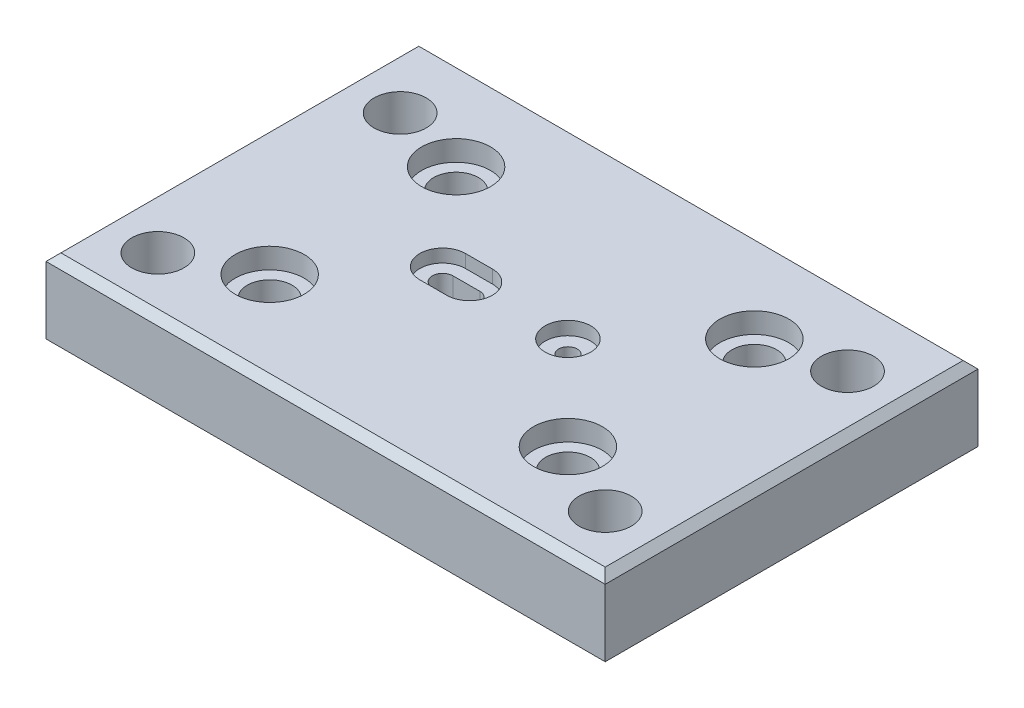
ISO-10303-21;
HEADER;
FILE_DESCRIPTION(('STEP AP214'),'2;1');
FILE_NAME('part.step','',(''),(''),'','','');
FILE_SCHEMA(('AUTOMOTIVE_DESIGN { 1 0 10303 214 1 1 1 1 }'));
ENDSEC;
DATA;
#1=APPLICATION_CONTEXT('core data for automotive mechanical design processes');
#2=APPLICATION_PROTOCOL_DEFINITION('international standard','automotive_design',2000,#1);
#3=PRODUCT_CONTEXT('',#1,'mechanical');
#4=PRODUCT('Part','Part','',(#3));
#5=PRODUCT_RELATED_PRODUCT_CATEGORY('part','',(#4));
#6=PRODUCT_DEFINITION_FORMATION('','',#4);
#7=PRODUCT_DEFINITION_CONTEXT('part definition',#1,'design');
#8=PRODUCT_DEFINITION('design','',#6,#7);
#9=PRODUCT_DEFINITION_SHAPE('','',#8);
#10=(LENGTH_UNIT() NAMED_UNIT(*) SI_UNIT(.MILLI.,.METRE.));
#11=(NAMED_UNIT(*) PLANE_ANGLE_UNIT() SI_UNIT($,.RADIAN.));
#12=(NAMED_UNIT(*) SI_UNIT($,.STERADIAN.) SOLID_ANGLE_UNIT());
#13=UNCERTAINTY_MEASURE_WITH_UNIT(LENGTH_MEASURE(1.E-05),#10,'distance_accuracy_value','');
#14=(GEOMETRIC_REPRESENTATION_CONTEXT(3) GLOBAL_UNCERTAINTY_ASSIGNED_CONTEXT((#13)) GLOBAL_UNIT_ASSIGNED_CONTEXT((#10,
#11,#12)) REPRESENTATION_CONTEXT('',''));
#15=CARTESIAN_POINT('',(0.,0.,0.));
#16=DIRECTION('',(0.,0.,1.));
#17=DIRECTION('',(1.,0.,0.));
#18=AXIS2_PLACEMENT_3D('',#15,#16,#17);
#19=CARTESIAN_POINT('',(-75.,20.,-50.));
#20=DIRECTION('',(1.,0.,0.));
#21=DIRECTION('',(0.,0.,-1.));
#22=AXIS2_PLACEMENT_3D('',#19,#20,#21);
#23=PLANE('',#22);
#24=DIRECTION('',(0.,-1.,0.));
#25=VECTOR('',#24,1.);
#26=CARTESIAN_POINT('',(-75.,20.,50.));
#27=LINE('',#26,#25);
#28=CARTESIAN_POINT('',(-75.,18.,50.));
#29=VERTEX_POINT('',#28);
#30=CARTESIAN_POINT('',(-75.,0.,50.));
#31=VERTEX_POINT('',#30);
#32=EDGE_CURVE('E322',#29,#31,#27,.T.);
#33=ORIENTED_EDGE('',*,*,#32,.F.);
#34=DIRECTION('',(0.,0.,-1.));
#35=VECTOR('',#34,1.);
#36=CARTESIAN_POINT('',(-75.,18.,-50.));
#37=LINE('',#36,#35);
#38=CARTESIAN_POINT('',(-75.,18.,-50.));
#39=VERTEX_POINT('',#38);
#40=EDGE_CURVE('E333',#29,#39,#37,.T.);
#41=ORIENTED_EDGE('',*,*,#40,.T.);
#42=DIRECTION('',(0.,-1.,0.));
#43=VECTOR('',#42,1.);
#44=CARTESIAN_POINT('',(-75.,20.,-50.));
#45=LINE('',#44,#43);
#46=CARTESIAN_POINT('',(-75.,0.,-50.));
#47=VERTEX_POINT('',#46);
#48=EDGE_CURVE('E316',#39,#47,#45,.T.);
#49=ORIENTED_EDGE('',*,*,#48,.T.);
#50=DIRECTION('',(0.,0.,1.));
#51=VECTOR('',#50,1.);
#52=CARTESIAN_POINT('',(-75.,0.,-50.));
#53=LINE('',#52,#51);
#54=EDGE_CURVE('E303',#47,#31,#53,.T.);
#55=ORIENTED_EDGE('',*,*,#54,.T.);
#56=EDGE_LOOP('',(#33,#41,#49,#55));
#57=FACE_BOUND('',#56,.T.);
#58=ADVANCED_FACE('F108',(#57),#23,.F.);
#59=CARTESIAN_POINT('',(-75.,20.,50.));
#60=DIRECTION('',(0.,0.,-1.));
#61=DIRECTION('',(-1.,0.,0.));
#62=AXIS2_PLACEMENT_3D('',#59,#60,#61);
#63=PLANE('',#62);
#64=DIRECTION('',(0.,-1.,0.));
#65=VECTOR('',#64,1.);
#66=CARTESIAN_POINT('',(75.,20.,50.));
#67=LINE('',#66,#65);
#68=CARTESIAN_POINT('',(75.,18.,50.));
#69=VERTEX_POINT('',#68);
#70=CARTESIAN_POINT('',(75.,0.,50.));
#71=VERTEX_POINT('',#70);
#72=EDGE_CURVE('E320',#69,#71,#67,.T.);
#73=ORIENTED_EDGE('',*,*,#72,.F.);
#74=DIRECTION('',(-1.,0.,0.));
#75=VECTOR('',#74,1.);
#76=CARTESIAN_POINT('',(-75.,18.,50.));
#77=LINE('',#76,#75);
#78=EDGE_CURVE('E340',#69,#29,#77,.T.);
#79=ORIENTED_EDGE('',*,*,#78,.T.);
#80=ORIENTED_EDGE('',*,*,#32,.T.);
#81=DIRECTION('',(1.,0.,0.));
#82=VECTOR('',#81,1.);
#83=CARTESIAN_POINT('',(-75.,0.,50.));
#84=LINE('',#83,#82);
#85=EDGE_CURVE('E306',#31,#71,#84,.T.);
#86=ORIENTED_EDGE('',*,*,#85,.T.);
#87=EDGE_LOOP('',(#73,#79,#80,#86));
#88=FACE_BOUND('',#87,.T.);
#89=ADVANCED_FACE('F516',(#88),#63,.F.);
#90=CARTESIAN_POINT('',(75.,20.,-50.));
#91=DIRECTION('',(-1.,0.,0.));
#92=DIRECTION('',(0.,0.,1.));
#93=AXIS2_PLACEMENT_3D('',#90,#91,#92);
#94=PLANE('',#93);
#95=DIRECTION('',(0.,-1.,0.));
#96=VECTOR('',#95,1.);
#97=CARTESIAN_POINT('',(75.,20.,-50.));
#98=LINE('',#97,#96);
#99=CARTESIAN_POINT('',(75.,18.,-50.));
#100=VERTEX_POINT('',#99);
#101=CARTESIAN_POINT('',(75.,0.,-50.));
#102=VERTEX_POINT('',#101);
#103=EDGE_CURVE('E318',#100,#102,#98,.T.);
#104=ORIENTED_EDGE('',*,*,#103,.F.);
#105=DIRECTION('',(0.,0.,1.));
#106=VECTOR('',#105,1.);
#107=CARTESIAN_POINT('',(75.,18.,50.));
#108=LINE('',#107,#106);
#109=EDGE_CURVE('E338',#100,#69,#108,.T.);
#110=ORIENTED_EDGE('',*,*,#109,.T.);
#111=ORIENTED_EDGE('',*,*,#72,.T.);
#112=DIRECTION('',(0.,0.,-1.));
#113=VECTOR('',#112,1.);
#114=CARTESIAN_POINT('',(75.,0.,-50.));
#115=LINE('',#114,#113);
#116=EDGE_CURVE('E310',#71,#102,#115,.T.);
#117=ORIENTED_EDGE('',*,*,#116,.T.);
#118=EDGE_LOOP('',(#104,#110,#111,#117));
#119=FACE_BOUND('',#118,.T.);
#120=ADVANCED_FACE('F511',(#119),#94,.F.);
#121=CARTESIAN_POINT('',(-75.,20.,-50.));
#122=DIRECTION('',(0.,0.,1.));
#123=DIRECTION('',(1.,0.,0.));
#124=AXIS2_PLACEMENT_3D('',#121,#122,#123);
#125=PLANE('',#124);
#126=ORIENTED_EDGE('',*,*,#48,.F.);
#127=DIRECTION('',(1.,0.,0.));
#128=VECTOR('',#127,1.);
#129=CARTESIAN_POINT('',(75.,18.,-50.));
#130=LINE('',#129,#128);
#131=EDGE_CURVE('E336',#39,#100,#130,.T.);
#132=ORIENTED_EDGE('',*,*,#131,.T.);
#133=ORIENTED_EDGE('',*,*,#103,.T.);
#134=DIRECTION('',(-1.,0.,0.));
#135=VECTOR('',#134,1.);
#136=CARTESIAN_POINT('',(-75.,0.,-50.));
#137=LINE('',#136,#135);
#138=EDGE_CURVE('E313',#102,#47,#137,.T.);
#139=ORIENTED_EDGE('',*,*,#138,.T.);
#140=EDGE_LOOP('',(#126,#132,#133,#139));
#141=FACE_BOUND('',#140,.T.);
#142=ADVANCED_FACE('F503',(#141),#125,.F.);
#143=CARTESIAN_POINT('',(-75.,20.,50.));
#144=DIRECTION('',(0.,1.,0.));
#145=DIRECTION('',(0.,0.,1.));
#146=AXIS2_PLACEMENT_3D('',#143,#144,#145);
#147=PLANE('',#146);
#148=CARTESIAN_POINT('',(15.,20.,0.));
#149=DIRECTION('',(0.,1.,0.));
#150=DIRECTION('',(0.,0.,1.));
#151=AXIS2_PLACEMENT_3D('',#148,#149,#150);
#152=CIRCLE('',#151,6.12);
#153=CARTESIAN_POINT('',(15.,20.,6.12));
#154=VERTEX_POINT('',#153);
#155=EDGE_CURVE('E414',#154,#154,#152,.T.);
#156=ORIENTED_EDGE('',*,*,#155,.F.);
#157=EDGE_LOOP('',(#156));
#158=FACE_BOUND('',#157,.T.);
#159=CARTESIAN_POINT('',(-11.4000163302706,20.,-0.0108433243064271));
#160=DIRECTION('',(0.,1.,0.));
#161=DIRECTION('',(0.,0.,1.));
#162=AXIS2_PLACEMENT_3D('',#159,#160,#161);
#163=CIRCLE('',#162,6.119);
#164=CARTESIAN_POINT('',(-11.3815856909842,20.,6.10812891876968));
#165=VERTEX_POINT('',#164);
#166=CARTESIAN_POINT('',(-11.418446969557,20.,-6.1298155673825));
#167=VERTEX_POINT('',#166);
#168=EDGE_CURVE('E242',#165,#167,#163,.T.);
#169=ORIENTED_EDGE('',*,*,#168,.F.);
#170=DIRECTION('',(0.999995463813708,0.,-0.0030120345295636));
#171=VECTOR('',#170,1.);
#172=CARTESIAN_POINT('',(-18.5815530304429,20.,6.12981556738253));
#173=LINE('',#172,#171);
#174=CARTESIAN_POINT('',(-18.581553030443,20.,6.12981556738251));
#175=VERTEX_POINT('',#174);
#176=EDGE_CURVE('E402',#175,#165,#173,.T.);
#177=ORIENTED_EDGE('',*,*,#176,.F.);
#178=CARTESIAN_POINT('',(-18.5999836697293,20.,0.0108433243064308));
#179=DIRECTION('',(0.,1.,0.));
#180=DIRECTION('',(0.,0.,1.));
#181=AXIS2_PLACEMENT_3D('',#178,#179,#180);
#182=CIRCLE('',#181,6.119);
#183=CARTESIAN_POINT('',(-18.6184143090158,20.,-6.10812891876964));
#184=VERTEX_POINT('',#183);
#185=EDGE_CURVE('E230',#184,#175,#182,.T.);
#186=ORIENTED_EDGE('',*,*,#185,.F.);
#187=DIRECTION('',(0.999995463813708,0.,-0.0030120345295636));
#188=VECTOR('',#187,1.);
#189=CARTESIAN_POINT('',(-18.6184143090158,20.,-6.10812891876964));
#190=LINE('',#189,#188);
#191=EDGE_CURVE('E218',#184,#167,#190,.T.);
#192=ORIENTED_EDGE('',*,*,#191,.T.);
#193=EDGE_LOOP('',(#169,#177,#186,#192));
#194=FACE_BOUND('',#193,.T.);
#195=CARTESIAN_POINT('',(60.,20.,-30.));
#196=DIRECTION('',(0.,1.,0.));
#197=DIRECTION('',(0.,0.,1.));
#198=AXIS2_PLACEMENT_3D('',#195,#196,#197);
#199=CIRCLE('',#198,6.99999999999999);
#200=CARTESIAN_POINT('',(60.,20.,-23.));
#201=VERTEX_POINT('',#200);
#202=EDGE_CURVE('E257',#201,#201,#199,.T.);
#203=ORIENTED_EDGE('',*,*,#202,.F.);
#204=EDGE_LOOP('',(#203));
#205=FACE_BOUND('',#204,.T.);
#206=CARTESIAN_POINT('',(-60.,20.,-30.));
#207=DIRECTION('',(0.,1.,0.));
#208=DIRECTION('',(0.,0.,1.));
#209=AXIS2_PLACEMENT_3D('',#206,#207,#208);
#210=CIRCLE('',#209,6.99999999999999);
#211=CARTESIAN_POINT('',(-60.,20.,-23.));
#212=VERTEX_POINT('',#211);
#213=EDGE_CURVE('E263',#212,#212,#210,.T.);
#214=ORIENTED_EDGE('',*,*,#213,.F.);
#215=EDGE_LOOP('',(#214));
#216=FACE_BOUND('',#215,.T.);
#217=CARTESIAN_POINT('',(60.,20.,35.));
#218=DIRECTION('',(0.,1.,0.));
#219=DIRECTION('',(0.,0.,1.));
#220=AXIS2_PLACEMENT_3D('',#217,#218,#219);
#221=CIRCLE('',#220,6.99999999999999);
#222=CARTESIAN_POINT('',(60.,20.,42.));
#223=VERTEX_POINT('',#222);
#224=EDGE_CURVE('E269',#223,#223,#221,.T.);
#225=ORIENTED_EDGE('',*,*,#224,.F.);
#226=EDGE_LOOP('',(#225));
#227=FACE_BOUND('',#226,.T.);
#228=CARTESIAN_POINT('',(-60.,20.,35.));
#229=DIRECTION('',(0.,1.,0.));
#230=DIRECTION('',(0.,0.,1.));
#231=AXIS2_PLACEMENT_3D('',#228,#229,#230);
#232=CIRCLE('',#231,6.99999999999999);
#233=CARTESIAN_POINT('',(-60.,20.,42.));
#234=VERTEX_POINT('',#233);
#235=EDGE_CURVE('E275',#234,#234,#232,.T.);
#236=ORIENTED_EDGE('',*,*,#235,.F.);
#237=EDGE_LOOP('',(#236));
#238=FACE_BOUND('',#237,.T.);
#239=CARTESIAN_POINT('',(40.,20.,25.));
#240=DIRECTION('',(0.,1.,0.));
#241=DIRECTION('',(0.,0.,1.));
#242=AXIS2_PLACEMENT_3D('',#239,#240,#241);
#243=CIRCLE('',#242,9.24999999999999);
#244=CARTESIAN_POINT('',(40.,20.,34.25));
#245=VERTEX_POINT('',#244);
#246=EDGE_CURVE('E281',#245,#245,#243,.T.);
#247=ORIENTED_EDGE('',*,*,#246,.F.);
#248=EDGE_LOOP('',(#247));
#249=FACE_BOUND('',#248,.T.);
#250=CARTESIAN_POINT('',(-40.,20.,25.));
#251=DIRECTION('',(0.,1.,0.));
#252=DIRECTION('',(0.,0.,1.));
#253=AXIS2_PLACEMENT_3D('',#250,#251,#252);
#254=CIRCLE('',#253,9.24999999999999);
#255=CARTESIAN_POINT('',(-40.,20.,34.25));
#256=VERTEX_POINT('',#255);
#257=EDGE_CURVE('E299',#256,#256,#254,.T.);
#258=ORIENTED_EDGE('',*,*,#257,.F.);
#259=EDGE_LOOP('',(#258));
#260=FACE_BOUND('',#259,.T.);
#261=DIRECTION('',(-1.,0.,0.));
#262=VECTOR('',#261,1.);
#263=CARTESIAN_POINT('',(-75.,20.,-48.));
#264=LINE('',#263,#262);
#265=CARTESIAN_POINT('',(73.,20.,-48.));
#266=VERTEX_POINT('',#265);
#267=CARTESIAN_POINT('',(-73.,20.,-48.));
#268=VERTEX_POINT('',#267);
#269=EDGE_CURVE('E328',#266,#268,#264,.T.);
#270=ORIENTED_EDGE('',*,*,#269,.T.);
#271=DIRECTION('',(0.,0.,1.));
#272=VECTOR('',#271,1.);
#273=CARTESIAN_POINT('',(-73.,20.,50.));
#274=LINE('',#273,#272);
#275=CARTESIAN_POINT('',(-73.,20.,48.));
#276=VERTEX_POINT('',#275);
#277=EDGE_CURVE('E330',#268,#276,#274,.T.);
#278=ORIENTED_EDGE('',*,*,#277,.T.);
#279=DIRECTION('',(1.,0.,0.));
#280=VECTOR('',#279,1.);
#281=CARTESIAN_POINT('',(75.,20.,48.));
#282=LINE('',#281,#280);
#283=CARTESIAN_POINT('',(73.,20.,48.));
#284=VERTEX_POINT('',#283);
#285=EDGE_CURVE('E324',#276,#284,#282,.T.);
#286=ORIENTED_EDGE('',*,*,#285,.T.);
#287=DIRECTION('',(0.,0.,-1.));
#288=VECTOR('',#287,1.);
#289=CARTESIAN_POINT('',(73.,20.,-50.));
#290=LINE('',#289,#288);
#291=EDGE_CURVE('E326',#284,#266,#290,.T.);
#292=ORIENTED_EDGE('',*,*,#291,.T.);
#293=EDGE_LOOP('',(#270,#278,#286,#292));
#294=FACE_BOUND('',#293,.T.);
#295=CARTESIAN_POINT('',(-40.,20.,-25.));
#296=DIRECTION('',(0.,1.,0.));
#297=DIRECTION('',(0.,0.,1.));
#298=AXIS2_PLACEMENT_3D('',#295,#296,#297);
#299=CIRCLE('',#298,9.24999999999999);
#300=CARTESIAN_POINT('',(-40.,20.,-15.75));
#301=VERTEX_POINT('',#300);
#302=EDGE_CURVE('E353',#301,#301,#299,.T.);
#303=ORIENTED_EDGE('',*,*,#302,.F.);
#304=EDGE_LOOP('',(#303));
#305=FACE_BOUND('',#304,.T.);
#306=CARTESIAN_POINT('',(40.,20.,-25.));
#307=DIRECTION('',(0.,1.,0.));
#308=DIRECTION('',(0.,0.,1.));
#309=AXIS2_PLACEMENT_3D('',#306,#307,#308);
#310=CIRCLE('',#309,9.24999999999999);
#311=CARTESIAN_POINT('',(40.,20.,-15.75));
#312=VERTEX_POINT('',#311);
#313=EDGE_CURVE('E365',#312,#312,#310,.T.);
#314=ORIENTED_EDGE('',*,*,#313,.F.);
#315=EDGE_LOOP('',(#314));
#316=FACE_BOUND('',#315,.T.);
#317=ADVANCED_FACE('F409',(#158,#194,#205,#216,#227,#238,#249,#260,#294,#305,#316),#147,.T.);
#318=CARTESIAN_POINT('',(-75.,0.,50.));
#319=DIRECTION('',(0.,1.,0.));
#320=DIRECTION('',(0.,0.,1.));
#321=AXIS2_PLACEMENT_3D('',#318,#319,#320);
#322=PLANE('',#321);
#323=CARTESIAN_POINT('',(15.,0.,0.));
#324=DIRECTION('',(0.,1.,0.));
#325=DIRECTION('',(0.,0.,1.));
#326=AXIS2_PLACEMENT_3D('',#323,#324,#325);
#327=CIRCLE('',#326,2.75);
#328=CARTESIAN_POINT('',(15.,0.,2.75));
#329=VERTEX_POINT('',#328);
#330=EDGE_CURVE('E442',#329,#329,#327,.T.);
#331=ORIENTED_EDGE('',*,*,#330,.T.);
#332=EDGE_LOOP('',(#331));
#333=FACE_BOUND('',#332,.T.);
#334=DIRECTION('',(0.999995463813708,0.,-0.0030120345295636));
#335=VECTOR('',#334,1.);
#336=CARTESIAN_POINT('',(-75.141773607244,0.,2.93116239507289));
#337=LINE('',#336,#335);
#338=CARTESIAN_POINT('',(-18.591700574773,0.,2.76083084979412));
#339=VERTEX_POINT('',#338);
#340=CARTESIAN_POINT('',(-11.3917332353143,0.,2.73914420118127));
#341=VERTEX_POINT('',#340);
#342=EDGE_CURVE('E377',#339,#341,#337,.T.);
#343=ORIENTED_EDGE('',*,*,#342,.T.);
#344=CARTESIAN_POINT('',(-11.4000163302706,0.,-0.0108433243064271));
#345=DIRECTION('',(0.,1.,0.));
#346=DIRECTION('',(0.,0.,1.));
#347=AXIS2_PLACEMENT_3D('',#344,#345,#346);
#348=CIRCLE('',#347,2.75);
#349=CARTESIAN_POINT('',(-11.4082994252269,0.,-2.76083084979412));
#350=VERTEX_POINT('',#349);
#351=EDGE_CURVE('E13',#341,#350,#348,.T.);
#352=ORIENTED_EDGE('',*,*,#351,.T.);
#353=DIRECTION('',(-0.999995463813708,0.,0.0030120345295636));
#354=VECTOR('',#353,1.);
#355=CARTESIAN_POINT('',(-75.1583397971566,0.,-2.5688126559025));
#356=LINE('',#355,#354);
#357=CARTESIAN_POINT('',(-18.6082667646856,0.,-2.73914420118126));
#358=VERTEX_POINT('',#357);
#359=EDGE_CURVE('E116',#350,#358,#356,.T.);
#360=ORIENTED_EDGE('',*,*,#359,.T.);
#361=CARTESIAN_POINT('',(-18.5999836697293,0.,0.0108433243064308));
#362=DIRECTION('',(0.,1.,0.));
#363=DIRECTION('',(0.,0.,1.));
#364=AXIS2_PLACEMENT_3D('',#361,#362,#363);
#365=CIRCLE('',#364,2.75);
#366=EDGE_CURVE('E374',#358,#339,#365,.T.);
#367=ORIENTED_EDGE('',*,*,#366,.T.);
#368=EDGE_LOOP('',(#343,#352,#360,#367));
#369=FACE_BOUND('',#368,.T.);
#370=CARTESIAN_POINT('',(60.,0.,-30.));
#371=DIRECTION('',(0.,1.,0.));
#372=DIRECTION('',(0.,0.,1.));
#373=AXIS2_PLACEMENT_3D('',#370,#371,#372);
#374=CIRCLE('',#373,6.99999999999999);
#375=CARTESIAN_POINT('',(60.,0.,-23.));
#376=VERTEX_POINT('',#375);
#377=EDGE_CURVE('E254',#376,#376,#374,.T.);
#378=ORIENTED_EDGE('',*,*,#377,.T.);
#379=EDGE_LOOP('',(#378));
#380=FACE_BOUND('',#379,.T.);
#381=CARTESIAN_POINT('',(-60.,0.,-30.));
#382=DIRECTION('',(0.,1.,0.));
#383=DIRECTION('',(0.,0.,1.));
#384=AXIS2_PLACEMENT_3D('',#381,#382,#383);
#385=CIRCLE('',#384,6.99999999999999);
#386=CARTESIAN_POINT('',(-60.,0.,-23.));
#387=VERTEX_POINT('',#386);
#388=EDGE_CURVE('E260',#387,#387,#385,.T.);
#389=ORIENTED_EDGE('',*,*,#388,.T.);
#390=EDGE_LOOP('',(#389));
#391=FACE_BOUND('',#390,.T.);
#392=CARTESIAN_POINT('',(60.,0.,35.));
#393=DIRECTION('',(0.,1.,0.));
#394=DIRECTION('',(0.,0.,1.));
#395=AXIS2_PLACEMENT_3D('',#392,#393,#394);
#396=CIRCLE('',#395,6.99999999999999);
#397=CARTESIAN_POINT('',(60.,0.,42.));
#398=VERTEX_POINT('',#397);
#399=EDGE_CURVE('E266',#398,#398,#396,.T.);
#400=ORIENTED_EDGE('',*,*,#399,.T.);
#401=EDGE_LOOP('',(#400));
#402=FACE_BOUND('',#401,.T.);
#403=CARTESIAN_POINT('',(-60.,0.,35.));
#404=DIRECTION('',(0.,1.,0.));
#405=DIRECTION('',(0.,0.,1.));
#406=AXIS2_PLACEMENT_3D('',#403,#404,#405);
#407=CIRCLE('',#406,6.99999999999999);
#408=CARTESIAN_POINT('',(-60.,0.,42.));
#409=VERTEX_POINT('',#408);
#410=EDGE_CURVE('E272',#409,#409,#407,.T.);
#411=ORIENTED_EDGE('',*,*,#410,.T.);
#412=EDGE_LOOP('',(#411));
#413=FACE_BOUND('',#412,.T.);
#414=CARTESIAN_POINT('',(40.,0.,25.));
#415=DIRECTION('',(0.,1.,0.));
#416=DIRECTION('',(0.,0.,1.));
#417=AXIS2_PLACEMENT_3D('',#414,#415,#416);
#418=CIRCLE('',#417,6.);
#419=CARTESIAN_POINT('',(40.,0.,31.));
#420=VERTEX_POINT('',#419);
#421=EDGE_CURVE('E278',#420,#420,#418,.T.);
#422=ORIENTED_EDGE('',*,*,#421,.T.);
#423=EDGE_LOOP('',(#422));
#424=FACE_BOUND('',#423,.T.);
#425=CARTESIAN_POINT('',(-40.,0.,25.));
#426=DIRECTION('',(0.,1.,0.));
#427=DIRECTION('',(0.,0.,1.));
#428=AXIS2_PLACEMENT_3D('',#425,#426,#427);
#429=CIRCLE('',#428,6.);
#430=CARTESIAN_POINT('',(-40.,0.,31.));
#431=VERTEX_POINT('',#430);
#432=EDGE_CURVE('E290',#431,#431,#429,.T.);
#433=ORIENTED_EDGE('',*,*,#432,.T.);
#434=EDGE_LOOP('',(#433));
#435=FACE_BOUND('',#434,.T.);
#436=ORIENTED_EDGE('',*,*,#54,.F.);
#437=ORIENTED_EDGE('',*,*,#138,.F.);
#438=ORIENTED_EDGE('',*,*,#116,.F.);
#439=ORIENTED_EDGE('',*,*,#85,.F.);
#440=EDGE_LOOP('',(#436,#437,#438,#439));
#441=FACE_BOUND('',#440,.T.);
#442=CARTESIAN_POINT('',(-40.,0.,-25.));
#443=DIRECTION('',(0.,1.,0.));
#444=DIRECTION('',(0.,0.,1.));
#445=AXIS2_PLACEMENT_3D('',#442,#443,#444);
#446=CIRCLE('',#445,6.);
#447=CARTESIAN_POINT('',(-40.,0.,-19.));
#448=VERTEX_POINT('',#447);
#449=EDGE_CURVE('E342',#448,#448,#446,.T.);
#450=ORIENTED_EDGE('',*,*,#449,.T.);
#451=EDGE_LOOP('',(#450));
#452=FACE_BOUND('',#451,.T.);
#453=CARTESIAN_POINT('',(40.,0.,-25.));
#454=DIRECTION('',(0.,1.,0.));
#455=DIRECTION('',(0.,0.,1.));
#456=AXIS2_PLACEMENT_3D('',#453,#454,#455);
#457=CIRCLE('',#456,6.);
#458=CARTESIAN_POINT('',(40.,0.,-19.));
#459=VERTEX_POINT('',#458);
#460=EDGE_CURVE('E362',#459,#459,#457,.T.);
#461=ORIENTED_EDGE('',*,*,#460,.T.);
#462=EDGE_LOOP('',(#461));
#463=FACE_BOUND('',#462,.T.);
#464=ADVANCED_FACE('F381',(#333,#369,#380,#391,#402,#413,#424,#435,#441,#452,#463),#322,.F.);
#465=CARTESIAN_POINT('',(73.,20.,50.));
#466=DIRECTION('',(0.707106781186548,0.707106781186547,0.));
#467=DIRECTION('',(-0.707106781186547,0.707106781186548,0.));
#468=AXIS2_PLACEMENT_3D('',#465,#466,#467);
#469=PLANE('',#468);
#470=DIRECTION('',(-0.577350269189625,0.577350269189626,-0.577350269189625));
#471=VECTOR('',#470,1.);
#472=CARTESIAN_POINT('',(23.6666666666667,69.3333333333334,-1.33333333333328));
#473=LINE('',#472,#471);
#474=EDGE_CURVE('E346',#69,#284,#473,.T.);
#475=ORIENTED_EDGE('',*,*,#474,.F.);
#476=ORIENTED_EDGE('',*,*,#109,.F.);
#477=DIRECTION('',(-0.577350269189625,0.577350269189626,0.577350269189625));
#478=VECTOR('',#477,1.);
#479=CARTESIAN_POINT('',(40.3333333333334,52.6666666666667,-15.3333333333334));
#480=LINE('',#479,#478);
#481=EDGE_CURVE('E307',#266,#100,#480,.F.);
#482=ORIENTED_EDGE('',*,*,#481,.F.);
#483=ORIENTED_EDGE('',*,*,#291,.F.);
#484=EDGE_LOOP('',(#475,#476,#482,#483));
#485=FACE_BOUND('',#484,.T.);
#486=ADVANCED_FACE('F509',(#485),#469,.T.);
#487=CARTESIAN_POINT('',(-75.,20.,-48.));
#488=DIRECTION('',(0.,0.707106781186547,-0.707106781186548));
#489=DIRECTION('',(0.,0.707106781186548,0.707106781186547));
#490=AXIS2_PLACEMENT_3D('',#487,#488,#489);
#491=PLANE('',#490);
#492=ORIENTED_EDGE('',*,*,#481,.T.);
#493=ORIENTED_EDGE('',*,*,#131,.F.);
#494=DIRECTION('',(0.577350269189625,0.577350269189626,0.577350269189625));
#495=VECTOR('',#494,1.);
#496=CARTESIAN_POINT('',(-73.6666666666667,19.3333333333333,-48.6666666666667));
#497=LINE('',#496,#495);
#498=EDGE_CURVE('E344',#268,#39,#497,.F.);
#499=ORIENTED_EDGE('',*,*,#498,.F.);
#500=ORIENTED_EDGE('',*,*,#269,.F.);
#501=EDGE_LOOP('',(#492,#493,#499,#500));
#502=FACE_BOUND('',#501,.T.);
#503=ADVANCED_FACE('F535',(#502),#491,.T.);
#504=CARTESIAN_POINT('',(-75.,20.,48.));
#505=DIRECTION('',(0.,0.707106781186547,0.707106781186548));
#506=DIRECTION('',(0.,-0.707106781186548,0.707106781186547));
#507=AXIS2_PLACEMENT_3D('',#504,#505,#506);
#508=PLANE('',#507);
#509=ORIENTED_EDGE('',*,*,#474,.T.);
#510=ORIENTED_EDGE('',*,*,#285,.F.);
#511=DIRECTION('',(-0.577350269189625,-0.577350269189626,0.577350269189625));
#512=VECTOR('',#511,1.);
#513=CARTESIAN_POINT('',(-73.6666666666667,19.3333333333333,48.6666666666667));
#514=LINE('',#513,#512);
#515=EDGE_CURVE('E302',#29,#276,#514,.F.);
#516=ORIENTED_EDGE('',*,*,#515,.F.);
#517=ORIENTED_EDGE('',*,*,#78,.F.);
#518=EDGE_LOOP('',(#509,#510,#516,#517));
#519=FACE_BOUND('',#518,.T.);
#520=ADVANCED_FACE('F531',(#519),#508,.T.);
#521=CARTESIAN_POINT('',(-73.,20.,50.));
#522=DIRECTION('',(-0.707106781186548,0.707106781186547,0.));
#523=DIRECTION('',(-0.707106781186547,-0.707106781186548,0.));
#524=AXIS2_PLACEMENT_3D('',#521,#522,#523);
#525=PLANE('',#524);
#526=ORIENTED_EDGE('',*,*,#498,.T.);
#527=ORIENTED_EDGE('',*,*,#40,.F.);
#528=ORIENTED_EDGE('',*,*,#515,.T.);
#529=ORIENTED_EDGE('',*,*,#277,.F.);
#530=EDGE_LOOP('',(#526,#527,#528,#529));
#531=FACE_BOUND('',#530,.T.);
#532=ADVANCED_FACE('F527',(#531),#525,.T.);
#533=CARTESIAN_POINT('',(-40.,20.,25.));
#534=DIRECTION('',(0.,1.,0.));
#535=DIRECTION('',(0.,0.,1.));
#536=AXIS2_PLACEMENT_3D('',#533,#534,#535);
#537=CYLINDRICAL_SURFACE('',#536,9.24999999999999);
#538=CARTESIAN_POINT('',(-40.,14.5,25.));
#539=DIRECTION('',(0.,1.,0.));
#540=DIRECTION('',(0.,0.,1.));
#541=AXIS2_PLACEMENT_3D('',#538,#539,#540);
#542=CIRCLE('',#541,9.24999999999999);
#543=CARTESIAN_POINT('',(-40.,14.5,34.25));
#544=VERTEX_POINT('',#543);
#545=EDGE_CURVE('E296',#544,#544,#542,.T.);
#546=ORIENTED_EDGE('',*,*,#545,.F.);
#547=EDGE_LOOP('',(#546));
#548=FACE_BOUND('',#547,.T.);
#549=ORIENTED_EDGE('',*,*,#257,.T.);
#550=EDGE_LOOP('',(#549));
#551=FACE_BOUND('',#550,.T.);
#552=ADVANCED_FACE('F530',(#548,#551),#537,.F.);
#553=CARTESIAN_POINT('',(-34.,14.5,25.));
#554=DIRECTION('',(0.,-1.,0.));
#555=DIRECTION('',(0.,0.,-1.));
#556=AXIS2_PLACEMENT_3D('',#553,#554,#555);
#557=PLANE('',#556);
#558=CARTESIAN_POINT('',(-40.,14.5,25.));
#559=DIRECTION('',(0.,1.,0.));
#560=DIRECTION('',(0.,0.,1.));
#561=AXIS2_PLACEMENT_3D('',#558,#559,#560);
#562=CIRCLE('',#561,6.);
#563=CARTESIAN_POINT('',(-40.,14.5,31.));
#564=VERTEX_POINT('',#563);
#565=EDGE_CURVE('E293',#564,#564,#562,.T.);
#566=ORIENTED_EDGE('',*,*,#565,.F.);
#567=EDGE_LOOP('',(#566));
#568=FACE_BOUND('',#567,.T.);
#569=ORIENTED_EDGE('',*,*,#545,.T.);
#570=EDGE_LOOP('',(#569));
#571=FACE_BOUND('',#570,.T.);
#572=ADVANCED_FACE('F620',(#568,#571),#557,.F.);
#573=CARTESIAN_POINT('',(-40.,20.,25.));
#574=DIRECTION('',(0.,1.,0.));
#575=DIRECTION('',(0.,0.,1.));
#576=AXIS2_PLACEMENT_3D('',#573,#574,#575);
#577=CYLINDRICAL_SURFACE('',#576,6.);
#578=ORIENTED_EDGE('',*,*,#432,.F.);
#579=EDGE_LOOP('',(#578));
#580=FACE_BOUND('',#579,.T.);
#581=ORIENTED_EDGE('',*,*,#565,.T.);
#582=EDGE_LOOP('',(#581));
#583=FACE_BOUND('',#582,.T.);
#584=ADVANCED_FACE('F612',(#580,#583),#577,.F.);
#585=CARTESIAN_POINT('',(40.,20.,25.));
#586=DIRECTION('',(0.,1.,0.));
#587=DIRECTION('',(0.,0.,1.));
#588=AXIS2_PLACEMENT_3D('',#585,#586,#587);
#589=CYLINDRICAL_SURFACE('',#588,9.24999999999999);
#590=CARTESIAN_POINT('',(40.,14.5,25.));
#591=DIRECTION('',(0.,1.,0.));
#592=DIRECTION('',(0.,0.,1.));
#593=AXIS2_PLACEMENT_3D('',#590,#591,#592);
#594=CIRCLE('',#593,9.24999999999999);
#595=CARTESIAN_POINT('',(40.,14.5,34.25));
#596=VERTEX_POINT('',#595);
#597=EDGE_CURVE('E287',#596,#596,#594,.T.);
#598=ORIENTED_EDGE('',*,*,#597,.F.);
#599=EDGE_LOOP('',(#598));
#600=FACE_BOUND('',#599,.T.);
#601=ORIENTED_EDGE('',*,*,#246,.T.);
#602=EDGE_LOOP('',(#601));
#603=FACE_BOUND('',#602,.T.);
#604=ADVANCED_FACE('F604',(#600,#603),#589,.F.);
#605=CARTESIAN_POINT('',(46.,14.5,25.));
#606=DIRECTION('',(0.,-1.,0.));
#607=DIRECTION('',(0.,0.,-1.));
#608=AXIS2_PLACEMENT_3D('',#605,#606,#607);
#609=PLANE('',#608);
#610=CARTESIAN_POINT('',(40.,14.5,25.));
#611=DIRECTION('',(0.,1.,0.));
#612=DIRECTION('',(0.,0.,1.));
#613=AXIS2_PLACEMENT_3D('',#610,#611,#612);
#614=CIRCLE('',#613,6.);
#615=CARTESIAN_POINT('',(40.,14.5,31.));
#616=VERTEX_POINT('',#615);
#617=EDGE_CURVE('E284',#616,#616,#614,.T.);
#618=ORIENTED_EDGE('',*,*,#617,.F.);
#619=EDGE_LOOP('',(#618));
#620=FACE_BOUND('',#619,.T.);
#621=ORIENTED_EDGE('',*,*,#597,.T.);
#622=EDGE_LOOP('',(#621));
#623=FACE_BOUND('',#622,.T.);
#624=ADVANCED_FACE('F596',(#620,#623),#609,.F.);
#625=CARTESIAN_POINT('',(40.,20.,25.));
#626=DIRECTION('',(0.,1.,0.));
#627=DIRECTION('',(0.,0.,1.));
#628=AXIS2_PLACEMENT_3D('',#625,#626,#627);
#629=CYLINDRICAL_SURFACE('',#628,6.);
#630=ORIENTED_EDGE('',*,*,#421,.F.);
#631=EDGE_LOOP('',(#630));
#632=FACE_BOUND('',#631,.T.);
#633=ORIENTED_EDGE('',*,*,#617,.T.);
#634=EDGE_LOOP('',(#633));
#635=FACE_BOUND('',#634,.T.);
#636=ADVANCED_FACE('F554',(#632,#635),#629,.F.);
#637=CARTESIAN_POINT('',(-40.,20.,-25.));
#638=DIRECTION('',(0.,1.,0.));
#639=DIRECTION('',(0.,0.,1.));
#640=AXIS2_PLACEMENT_3D('',#637,#638,#639);
#641=CYLINDRICAL_SURFACE('',#640,6.);
#642=ORIENTED_EDGE('',*,*,#449,.F.);
#643=EDGE_LOOP('',(#642));
#644=FACE_BOUND('',#643,.T.);
#645=CARTESIAN_POINT('',(-40.,14.5,-25.));
#646=DIRECTION('',(0.,1.,0.));
#647=DIRECTION('',(0.,0.,1.));
#648=AXIS2_PLACEMENT_3D('',#645,#646,#647);
#649=CIRCLE('',#648,6.);
#650=CARTESIAN_POINT('',(-40.,14.5,-19.));
#651=VERTEX_POINT('',#650);
#652=EDGE_CURVE('E359',#651,#651,#649,.T.);
#653=ORIENTED_EDGE('',*,*,#652,.T.);
#654=EDGE_LOOP('',(#653));
#655=FACE_BOUND('',#654,.T.);
#656=ADVANCED_FACE('F550',(#644,#655),#641,.F.);
#657=CARTESIAN_POINT('',(-34.,14.5,-25.));
#658=DIRECTION('',(0.,-1.,0.));
#659=DIRECTION('',(0.,0.,-1.));
#660=AXIS2_PLACEMENT_3D('',#657,#658,#659);
#661=PLANE('',#660);
#662=ORIENTED_EDGE('',*,*,#652,.F.);
#663=EDGE_LOOP('',(#662));
#664=FACE_BOUND('',#663,.T.);
#665=CARTESIAN_POINT('',(-40.,14.5,-25.));
#666=DIRECTION('',(0.,1.,0.));
#667=DIRECTION('',(0.,0.,1.));
#668=AXIS2_PLACEMENT_3D('',#665,#666,#667);
#669=CIRCLE('',#668,9.24999999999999);
#670=CARTESIAN_POINT('',(-40.,14.5,-15.75));
#671=VERTEX_POINT('',#670);
#672=EDGE_CURVE('E356',#671,#671,#669,.T.);
#673=ORIENTED_EDGE('',*,*,#672,.T.);
#674=EDGE_LOOP('',(#673));
#675=FACE_BOUND('',#674,.T.);
#676=ADVANCED_FACE('F546',(#664,#675),#661,.F.);
#677=CARTESIAN_POINT('',(-40.,20.,-25.));
#678=DIRECTION('',(0.,1.,0.));
#679=DIRECTION('',(0.,0.,1.));
#680=AXIS2_PLACEMENT_3D('',#677,#678,#679);
#681=CYLINDRICAL_SURFACE('',#680,9.24999999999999);
#682=ORIENTED_EDGE('',*,*,#672,.F.);
#683=EDGE_LOOP('',(#682));
#684=FACE_BOUND('',#683,.T.);
#685=ORIENTED_EDGE('',*,*,#302,.T.);
#686=EDGE_LOOP('',(#685));
#687=FACE_BOUND('',#686,.T.);
#688=ADVANCED_FACE('F543',(#684,#687),#681,.F.);
#689=CARTESIAN_POINT('',(40.,20.,-25.));
#690=DIRECTION('',(0.,1.,0.));
#691=DIRECTION('',(0.,0.,1.));
#692=AXIS2_PLACEMENT_3D('',#689,#690,#691);
#693=CYLINDRICAL_SURFACE('',#692,6.);
#694=ORIENTED_EDGE('',*,*,#460,.F.);
#695=EDGE_LOOP('',(#694));
#696=FACE_BOUND('',#695,.T.);
#697=CARTESIAN_POINT('',(40.,14.5,-25.));
#698=DIRECTION('',(0.,1.,0.));
#699=DIRECTION('',(0.,0.,1.));
#700=AXIS2_PLACEMENT_3D('',#697,#698,#699);
#701=CIRCLE('',#700,6.);
#702=CARTESIAN_POINT('',(40.,14.5,-19.));
#703=VERTEX_POINT('',#702);
#704=EDGE_CURVE('E371',#703,#703,#701,.T.);
#705=ORIENTED_EDGE('',*,*,#704,.T.);
#706=EDGE_LOOP('',(#705));
#707=FACE_BOUND('',#706,.T.);
#708=ADVANCED_FACE('F110',(#696,#707),#693,.F.);
#709=CARTESIAN_POINT('',(46.,14.5,-25.));
#710=DIRECTION('',(0.,-1.,0.));
#711=DIRECTION('',(0.,0.,-1.));
#712=AXIS2_PLACEMENT_3D('',#709,#710,#711);
#713=PLANE('',#712);
#714=ORIENTED_EDGE('',*,*,#704,.F.);
#715=EDGE_LOOP('',(#714));
#716=FACE_BOUND('',#715,.T.);
#717=CARTESIAN_POINT('',(40.,14.5,-25.));
#718=DIRECTION('',(0.,1.,0.));
#719=DIRECTION('',(0.,0.,1.));
#720=AXIS2_PLACEMENT_3D('',#717,#718,#719);
#721=CIRCLE('',#720,9.24999999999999);
#722=CARTESIAN_POINT('',(40.,14.5,-15.75));
#723=VERTEX_POINT('',#722);
#724=EDGE_CURVE('E368',#723,#723,#721,.T.);
#725=ORIENTED_EDGE('',*,*,#724,.T.);
#726=EDGE_LOOP('',(#725));
#727=FACE_BOUND('',#726,.T.);
#728=ADVANCED_FACE('F559',(#716,#727),#713,.F.);
#729=CARTESIAN_POINT('',(40.,20.,-25.));
#730=DIRECTION('',(0.,1.,0.));
#731=DIRECTION('',(0.,0.,1.));
#732=AXIS2_PLACEMENT_3D('',#729,#730,#731);
#733=CYLINDRICAL_SURFACE('',#732,9.24999999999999);
#734=ORIENTED_EDGE('',*,*,#724,.F.);
#735=EDGE_LOOP('',(#734));
#736=FACE_BOUND('',#735,.T.);
#737=ORIENTED_EDGE('',*,*,#313,.T.);
#738=EDGE_LOOP('',(#737));
#739=FACE_BOUND('',#738,.T.);
#740=ADVANCED_FACE('F556',(#736,#739),#733,.F.);
#741=CARTESIAN_POINT('',(-60.,20.,35.));
#742=DIRECTION('',(0.,1.,0.));
#743=DIRECTION('',(0.,0.,1.));
#744=AXIS2_PLACEMENT_3D('',#741,#742,#743);
#745=CYLINDRICAL_SURFACE('',#744,6.99999999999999);
#746=ORIENTED_EDGE('',*,*,#410,.F.);
#747=EDGE_LOOP('',(#746));
#748=FACE_BOUND('',#747,.T.);
#749=ORIENTED_EDGE('',*,*,#235,.T.);
#750=EDGE_LOOP('',(#749));
#751=FACE_BOUND('',#750,.T.);
#752=ADVANCED_FACE('F558',(#748,#751),#745,.F.);
#753=CARTESIAN_POINT('',(60.,20.,35.));
#754=DIRECTION('',(0.,1.,0.));
#755=DIRECTION('',(0.,0.,1.));
#756=AXIS2_PLACEMENT_3D('',#753,#754,#755);
#757=CYLINDRICAL_SURFACE('',#756,6.99999999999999);
#758=ORIENTED_EDGE('',*,*,#399,.F.);
#759=EDGE_LOOP('',(#758));
#760=FACE_BOUND('',#759,.T.);
#761=ORIENTED_EDGE('',*,*,#224,.T.);
#762=EDGE_LOOP('',(#761));
#763=FACE_BOUND('',#762,.T.);
#764=ADVANCED_FACE('F786',(#760,#763),#757,.F.);
#765=CARTESIAN_POINT('',(-60.,20.,-30.));
#766=DIRECTION('',(0.,1.,0.));
#767=DIRECTION('',(0.,0.,1.));
#768=AXIS2_PLACEMENT_3D('',#765,#766,#767);
#769=CYLINDRICAL_SURFACE('',#768,6.99999999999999);
#770=ORIENTED_EDGE('',*,*,#388,.F.);
#771=EDGE_LOOP('',(#770));
#772=FACE_BOUND('',#771,.T.);
#773=ORIENTED_EDGE('',*,*,#213,.T.);
#774=EDGE_LOOP('',(#773));
#775=FACE_BOUND('',#774,.T.);
#776=ADVANCED_FACE('F778',(#772,#775),#769,.F.);
#777=CARTESIAN_POINT('',(60.,20.,-30.));
#778=DIRECTION('',(0.,1.,0.));
#779=DIRECTION('',(0.,0.,1.));
#780=AXIS2_PLACEMENT_3D('',#777,#778,#779);
#781=CYLINDRICAL_SURFACE('',#780,6.99999999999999);
#782=ORIENTED_EDGE('',*,*,#377,.F.);
#783=EDGE_LOOP('',(#782));
#784=FACE_BOUND('',#783,.T.);
#785=ORIENTED_EDGE('',*,*,#202,.T.);
#786=EDGE_LOOP('',(#785));
#787=FACE_BOUND('',#786,.T.);
#788=ADVANCED_FACE('F771',(#784,#787),#781,.F.);
#789=CARTESIAN_POINT('',(-11.4000163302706,20.,-0.0108433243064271));
#790=DIRECTION('',(0.,1.,0.));
#791=DIRECTION('',(0.,0.,1.));
#792=AXIS2_PLACEMENT_3D('',#789,#790,#791);
#793=CYLINDRICAL_SURFACE('',#792,2.75);
#794=DIRECTION('',(0.,1.,0.));
#795=VECTOR('',#794,1.);
#796=CARTESIAN_POINT('',(-11.3917332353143,20.,2.73914420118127));
#797=LINE('',#796,#795);
#798=CARTESIAN_POINT('',(-11.3917332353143,16.5,2.73914420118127));
#799=VERTEX_POINT('',#798);
#800=EDGE_CURVE('E239',#799,#341,#797,.F.);
#801=ORIENTED_EDGE('',*,*,#800,.F.);
#802=CARTESIAN_POINT('',(-11.4000163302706,16.5,-0.0108433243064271));
#803=DIRECTION('',(0.,1.,0.));
#804=DIRECTION('',(0.,0.,1.));
#805=AXIS2_PLACEMENT_3D('',#802,#803,#804);
#806=CIRCLE('',#805,2.75);
#807=CARTESIAN_POINT('',(-11.4082994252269,16.5,-2.76083084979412));
#808=VERTEX_POINT('',#807);
#809=EDGE_CURVE('E246',#799,#808,#806,.T.);
#810=ORIENTED_EDGE('',*,*,#809,.T.);
#811=DIRECTION('',(0.,1.,0.));
#812=VECTOR('',#811,1.);
#813=CARTESIAN_POINT('',(-11.4082994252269,20.,-2.76083084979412));
#814=LINE('',#813,#812);
#815=EDGE_CURVE('E224',#350,#808,#814,.T.);
#816=ORIENTED_EDGE('',*,*,#815,.F.);
#817=ORIENTED_EDGE('',*,*,#351,.F.);
#818=EDGE_LOOP('',(#801,#810,#816,#817));
#819=FACE_BOUND('',#818,.T.);
#820=ADVANCED_FACE('F391',(#819),#793,.F.);
#821=CARTESIAN_POINT('',(-18.6082667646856,20.,-2.73914420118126));
#822=DIRECTION('',(-0.0030120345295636,0.,-0.999995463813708));
#823=DIRECTION('',(-0.999995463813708,0.,0.0030120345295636));
#824=AXIS2_PLACEMENT_3D('',#821,#822,#823);
#825=PLANE('',#824);
#826=ORIENTED_EDGE('',*,*,#815,.T.);
#827=DIRECTION('',(0.999995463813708,0.,-0.0030120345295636));
#828=VECTOR('',#827,1.);
#829=CARTESIAN_POINT('',(-18.6082667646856,16.5,-2.73914420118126));
#830=LINE('',#829,#828);
#831=CARTESIAN_POINT('',(-18.6082667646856,16.5,-2.73914420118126));
#832=VERTEX_POINT('',#831);
#833=EDGE_CURVE('E219',#832,#808,#830,.T.);
#834=ORIENTED_EDGE('',*,*,#833,.F.);
#835=DIRECTION('',(0.,1.,0.));
#836=VECTOR('',#835,1.);
#837=CARTESIAN_POINT('',(-18.6082667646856,20.,-2.73914420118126));
#838=LINE('',#837,#836);
#839=EDGE_CURVE('E233',#832,#358,#838,.F.);
#840=ORIENTED_EDGE('',*,*,#839,.T.);
#841=ORIENTED_EDGE('',*,*,#359,.F.);
#842=EDGE_LOOP('',(#826,#834,#840,#841));
#843=FACE_BOUND('',#842,.T.);
#844=ADVANCED_FACE('F386',(#843),#825,.F.);
#845=CARTESIAN_POINT('',(-18.591700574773,20.,2.76083084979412));
#846=DIRECTION('',(0.0030120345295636,0.,0.999995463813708));
#847=DIRECTION('',(0.999995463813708,0.,-0.0030120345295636));
#848=AXIS2_PLACEMENT_3D('',#845,#846,#847);
#849=PLANE('',#848);
#850=DIRECTION('',(0.,1.,0.));
#851=VECTOR('',#850,1.);
#852=CARTESIAN_POINT('',(-18.591700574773,20.,2.76083084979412));
#853=LINE('',#852,#851);
#854=CARTESIAN_POINT('',(-18.591700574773,16.5,2.76083084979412));
#855=VERTEX_POINT('',#854);
#856=EDGE_CURVE('E123',#339,#855,#853,.T.);
#857=ORIENTED_EDGE('',*,*,#856,.T.);
#858=DIRECTION('',(0.999995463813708,0.,-0.0030120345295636));
#859=VECTOR('',#858,1.);
#860=CARTESIAN_POINT('',(-18.591700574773,16.5,2.76083084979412));
#861=LINE('',#860,#859);
#862=EDGE_CURVE('E396',#855,#799,#861,.T.);
#863=ORIENTED_EDGE('',*,*,#862,.T.);
#864=ORIENTED_EDGE('',*,*,#800,.T.);
#865=ORIENTED_EDGE('',*,*,#342,.F.);
#866=EDGE_LOOP('',(#857,#863,#864,#865));
#867=FACE_BOUND('',#866,.T.);
#868=ADVANCED_FACE('F398',(#867),#849,.F.);
#869=CARTESIAN_POINT('',(-18.5999836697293,20.,0.0108433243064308));
#870=DIRECTION('',(0.,1.,0.));
#871=DIRECTION('',(0.,0.,1.));
#872=AXIS2_PLACEMENT_3D('',#869,#870,#871);
#873=CYLINDRICAL_SURFACE('',#872,2.75);
#874=ORIENTED_EDGE('',*,*,#839,.F.);
#875=CARTESIAN_POINT('',(-18.5999836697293,16.5,0.0108433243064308));
#876=DIRECTION('',(0.,1.,0.));
#877=DIRECTION('',(0.,0.,1.));
#878=AXIS2_PLACEMENT_3D('',#875,#876,#877);
#879=CIRCLE('',#878,2.75);
#880=EDGE_CURVE('E229',#832,#855,#879,.T.);
#881=ORIENTED_EDGE('',*,*,#880,.T.);
#882=ORIENTED_EDGE('',*,*,#856,.F.);
#883=ORIENTED_EDGE('',*,*,#366,.F.);
#884=EDGE_LOOP('',(#874,#881,#882,#883));
#885=FACE_BOUND('',#884,.T.);
#886=ADVANCED_FACE('F746',(#885),#873,.F.);
#887=CARTESIAN_POINT('',(-8.65001633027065,16.5,-0.0108433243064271));
#888=DIRECTION('',(0.,-1.,0.));
#889=DIRECTION('',(0.,0.,-1.));
#890=AXIS2_PLACEMENT_3D('',#887,#888,#889);
#891=PLANE('',#890);
#892=ORIENTED_EDGE('',*,*,#862,.F.);
#893=ORIENTED_EDGE('',*,*,#880,.F.);
#894=ORIENTED_EDGE('',*,*,#833,.T.);
#895=ORIENTED_EDGE('',*,*,#809,.F.);
#896=EDGE_LOOP('',(#892,#893,#894,#895));
#897=FACE_BOUND('',#896,.T.);
#898=CARTESIAN_POINT('',(-11.4000163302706,16.5,-0.0108433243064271));
#899=DIRECTION('',(0.,1.,0.));
#900=DIRECTION('',(0.,0.,1.));
#901=AXIS2_PLACEMENT_3D('',#898,#899,#900);
#902=CIRCLE('',#901,6.11899999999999);
#903=CARTESIAN_POINT('',(-11.3815856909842,16.5,6.10812891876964));
#904=VERTEX_POINT('',#903);
#905=CARTESIAN_POINT('',(-11.418446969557,16.5,-6.1298155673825));
#906=VERTEX_POINT('',#905);
#907=EDGE_CURVE('E215',#904,#906,#902,.T.);
#908=ORIENTED_EDGE('',*,*,#907,.T.);
#909=DIRECTION('',(0.999995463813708,0.,-0.0030120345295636));
#910=VECTOR('',#909,1.);
#911=CARTESIAN_POINT('',(-18.6184143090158,16.5,-6.10812891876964));
#912=LINE('',#911,#910);
#913=CARTESIAN_POINT('',(-18.6184143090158,16.5,-6.10812891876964));
#914=VERTEX_POINT('',#913);
#915=EDGE_CURVE('E211',#914,#906,#912,.T.);
#916=ORIENTED_EDGE('',*,*,#915,.F.);
#917=CARTESIAN_POINT('',(-18.5999836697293,16.5,0.0108433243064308));
#918=DIRECTION('',(0.,1.,0.));
#919=DIRECTION('',(0.,0.,1.));
#920=AXIS2_PLACEMENT_3D('',#917,#918,#919);
#921=CIRCLE('',#920,6.11899999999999);
#922=CARTESIAN_POINT('',(-18.5815530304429,16.5,6.1298155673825));
#923=VERTEX_POINT('',#922);
#924=EDGE_CURVE('E214',#914,#923,#921,.T.);
#925=ORIENTED_EDGE('',*,*,#924,.T.);
#926=DIRECTION('',(0.999995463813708,0.,-0.0030120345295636));
#927=VECTOR('',#926,1.);
#928=CARTESIAN_POINT('',(-18.5815530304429,16.5,6.1298155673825));
#929=LINE('',#928,#927);
#930=EDGE_CURVE('E399',#923,#904,#929,.T.);
#931=ORIENTED_EDGE('',*,*,#930,.T.);
#932=EDGE_LOOP('',(#908,#916,#925,#931));
#933=FACE_BOUND('',#932,.T.);
#934=ADVANCED_FACE('F212',(#897,#933),#891,.F.);
#935=CARTESIAN_POINT('',(-11.4000163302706,20.,-0.0108433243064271));
#936=DIRECTION('',(0.,1.,0.));
#937=DIRECTION('',(0.,0.,1.));
#938=AXIS2_PLACEMENT_3D('',#935,#936,#937);
#939=CYLINDRICAL_SURFACE('',#938,6.11899999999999);
#940=ORIENTED_EDGE('',*,*,#907,.F.);
#941=DIRECTION('',(0.,1.,0.));
#942=VECTOR('',#941,1.);
#943=CARTESIAN_POINT('',(-11.3815856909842,20.,6.10812891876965));
#944=LINE('',#943,#942);
#945=EDGE_CURVE('E251',#165,#904,#944,.F.);
#946=ORIENTED_EDGE('',*,*,#945,.F.);
#947=ORIENTED_EDGE('',*,*,#168,.T.);
#948=DIRECTION('',(0.,1.,0.));
#949=VECTOR('',#948,1.);
#950=CARTESIAN_POINT('',(-11.418446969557,20.,-6.1298155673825));
#951=LINE('',#950,#949);
#952=EDGE_CURVE('E249',#906,#167,#951,.T.);
#953=ORIENTED_EDGE('',*,*,#952,.F.);
#954=EDGE_LOOP('',(#940,#946,#947,#953));
#955=FACE_BOUND('',#954,.T.);
#956=ADVANCED_FACE('F732',(#955),#939,.F.);
#957=CARTESIAN_POINT('',(-18.5999836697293,20.,0.0108433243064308));
#958=DIRECTION('',(0.,1.,0.));
#959=DIRECTION('',(0.,0.,1.));
#960=AXIS2_PLACEMENT_3D('',#957,#958,#959);
#961=CYLINDRICAL_SURFACE('',#960,6.11899999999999);
#962=ORIENTED_EDGE('',*,*,#185,.T.);
#963=DIRECTION('',(0.,1.,0.));
#964=VECTOR('',#963,1.);
#965=CARTESIAN_POINT('',(-18.581553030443,20.,6.1298155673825));
#966=LINE('',#965,#964);
#967=EDGE_CURVE('E225',#923,#175,#966,.T.);
#968=ORIENTED_EDGE('',*,*,#967,.F.);
#969=ORIENTED_EDGE('',*,*,#924,.F.);
#970=DIRECTION('',(0.,1.,0.));
#971=VECTOR('',#970,1.);
#972=CARTESIAN_POINT('',(-18.6184143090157,20.,-6.10812891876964));
#973=LINE('',#972,#971);
#974=EDGE_CURVE('E131',#184,#914,#973,.F.);
#975=ORIENTED_EDGE('',*,*,#974,.F.);
#976=EDGE_LOOP('',(#962,#968,#969,#975));
#977=FACE_BOUND('',#976,.T.);
#978=ADVANCED_FACE('F228',(#977),#961,.F.);
#979=CARTESIAN_POINT('',(-18.6184143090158,20.,-6.10812891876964));
#980=DIRECTION('',(-0.0030120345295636,0.,-0.999995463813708));
#981=DIRECTION('',(-0.999995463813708,0.,0.0030120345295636));
#982=AXIS2_PLACEMENT_3D('',#979,#980,#981);
#983=PLANE('',#982);
#984=ORIENTED_EDGE('',*,*,#952,.T.);
#985=ORIENTED_EDGE('',*,*,#191,.F.);
#986=ORIENTED_EDGE('',*,*,#974,.T.);
#987=ORIENTED_EDGE('',*,*,#915,.T.);
#988=EDGE_LOOP('',(#984,#985,#986,#987));
#989=FACE_BOUND('',#988,.T.);
#990=ADVANCED_FACE('F221',(#989),#983,.F.);
#991=CARTESIAN_POINT('',(-18.5815530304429,20.,6.1298155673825));
#992=DIRECTION('',(0.0030120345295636,0.,0.999995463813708));
#993=DIRECTION('',(0.999995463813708,0.,-0.0030120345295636));
#994=AXIS2_PLACEMENT_3D('',#991,#992,#993);
#995=PLANE('',#994);
#996=ORIENTED_EDGE('',*,*,#945,.T.);
#997=ORIENTED_EDGE('',*,*,#930,.F.);
#998=ORIENTED_EDGE('',*,*,#967,.T.);
#999=ORIENTED_EDGE('',*,*,#176,.T.);
#1000=EDGE_LOOP('',(#996,#997,#998,#999));
#1001=FACE_BOUND('',#1000,.T.);
#1002=ADVANCED_FACE('F498',(#1001),#995,.F.);
#1003=CARTESIAN_POINT('',(15.,20.,0.));
#1004=DIRECTION('',(0.,1.,0.));
#1005=DIRECTION('',(0.,0.,1.));
#1006=AXIS2_PLACEMENT_3D('',#1003,#1004,#1005);
#1007=CYLINDRICAL_SURFACE('',#1006,6.12);
#1008=CARTESIAN_POINT('',(15.,16.42,0.));
#1009=DIRECTION('',(0.,1.,0.));
#1010=DIRECTION('',(0.,0.,1.));
#1011=AXIS2_PLACEMENT_3D('',#1008,#1009,#1010);
#1012=CIRCLE('',#1011,6.12);
#1013=CARTESIAN_POINT('',(15.,16.42,6.12));
#1014=VERTEX_POINT('',#1013);
#1015=EDGE_CURVE('E416',#1014,#1014,#1012,.T.);
#1016=ORIENTED_EDGE('',*,*,#1015,.F.);
#1017=EDGE_LOOP('',(#1016));
#1018=FACE_BOUND('',#1017,.T.);
#1019=ORIENTED_EDGE('',*,*,#155,.T.);
#1020=EDGE_LOOP('',(#1019));
#1021=FACE_BOUND('',#1020,.T.);
#1022=ADVANCED_FACE('F492',(#1018,#1021),#1007,.F.);
#1023=CARTESIAN_POINT('',(21.12,16.42,0.));
#1024=DIRECTION('',(0.,-1.,0.));
#1025=DIRECTION('',(0.,0.,-1.));
#1026=AXIS2_PLACEMENT_3D('',#1023,#1024,#1025);
#1027=PLANE('',#1026);
#1028=CARTESIAN_POINT('',(15.,16.42,0.));
#1029=DIRECTION('',(0.,1.,0.));
#1030=DIRECTION('',(0.,0.,1.));
#1031=AXIS2_PLACEMENT_3D('',#1028,#1029,#1030);
#1032=CIRCLE('',#1031,2.5);
#1033=CARTESIAN_POINT('',(15.,16.42,2.5));
#1034=VERTEX_POINT('',#1033);
#1035=EDGE_CURVE('E421',#1034,#1034,#1032,.T.);
#1036=ORIENTED_EDGE('',*,*,#1035,.F.);
#1037=EDGE_LOOP('',(#1036));
#1038=FACE_BOUND('',#1037,.T.);
#1039=ORIENTED_EDGE('',*,*,#1015,.T.);
#1040=EDGE_LOOP('',(#1039));
#1041=FACE_BOUND('',#1040,.T.);
#1042=ADVANCED_FACE('F486',(#1038,#1041),#1027,.F.);
#1043=CARTESIAN_POINT('',(15.,20.,0.));
#1044=DIRECTION('',(0.,1.,0.));
#1045=DIRECTION('',(0.,0.,1.));
#1046=AXIS2_PLACEMENT_3D('',#1043,#1044,#1045);
#1047=CYLINDRICAL_SURFACE('',#1046,2.5);
#1048=CARTESIAN_POINT('',(15.,11.42,0.));
#1049=DIRECTION('',(0.,1.,0.));
#1050=DIRECTION('',(0.,0.,1.));
#1051=AXIS2_PLACEMENT_3D('',#1048,#1049,#1050);
#1052=CIRCLE('',#1051,2.5);
#1053=CARTESIAN_POINT('',(15.,11.42,2.5));
#1054=VERTEX_POINT('',#1053);
#1055=EDGE_CURVE('E424',#1054,#1054,#1052,.T.);
#1056=ORIENTED_EDGE('',*,*,#1055,.F.);
#1057=EDGE_LOOP('',(#1056));
#1058=FACE_BOUND('',#1057,.T.);
#1059=ORIENTED_EDGE('',*,*,#1035,.T.);
#1060=EDGE_LOOP('',(#1059));
#1061=FACE_BOUND('',#1060,.T.);
#1062=ADVANCED_FACE('F480',(#1058,#1061),#1047,.F.);
#1063=CARTESIAN_POINT('',(21.12,11.42,0.));
#1064=DIRECTION('',(0.,1.,0.));
#1065=DIRECTION('',(0.,0.,1.));
#1066=AXIS2_PLACEMENT_3D('',#1063,#1064,#1065);
#1067=PLANE('',#1066);
#1068=CARTESIAN_POINT('',(15.,11.42,0.));
#1069=DIRECTION('',(0.,1.,0.));
#1070=DIRECTION('',(0.,0.,1.));
#1071=AXIS2_PLACEMENT_3D('',#1068,#1069,#1070);
#1072=CIRCLE('',#1071,6.12);
#1073=CARTESIAN_POINT('',(15.,11.42,6.12));
#1074=VERTEX_POINT('',#1073);
#1075=EDGE_CURVE('E427',#1074,#1074,#1072,.T.);
#1076=ORIENTED_EDGE('',*,*,#1075,.F.);
#1077=EDGE_LOOP('',(#1076));
#1078=FACE_BOUND('',#1077,.T.);
#1079=ORIENTED_EDGE('',*,*,#1055,.T.);
#1080=EDGE_LOOP('',(#1079));
#1081=FACE_BOUND('',#1080,.T.);
#1082=ADVANCED_FACE('F474',(#1078,#1081),#1067,.F.);
#1083=CARTESIAN_POINT('',(15.,20.,0.));
#1084=DIRECTION('',(0.,1.,0.));
#1085=DIRECTION('',(0.,0.,1.));
#1086=AXIS2_PLACEMENT_3D('',#1083,#1084,#1085);
#1087=CYLINDRICAL_SURFACE('',#1086,6.12);
#1088=CARTESIAN_POINT('',(15.,7.45,0.));
#1089=DIRECTION('',(0.,1.,0.));
#1090=DIRECTION('',(0.,0.,1.));
#1091=AXIS2_PLACEMENT_3D('',#1088,#1089,#1090);
#1092=CIRCLE('',#1091,6.12);
#1093=CARTESIAN_POINT('',(15.,7.45,6.12));
#1094=VERTEX_POINT('',#1093);
#1095=EDGE_CURVE('E430',#1094,#1094,#1092,.T.);
#1096=ORIENTED_EDGE('',*,*,#1095,.F.);
#1097=EDGE_LOOP('',(#1096));
#1098=FACE_BOUND('',#1097,.T.);
#1099=ORIENTED_EDGE('',*,*,#1075,.T.);
#1100=EDGE_LOOP('',(#1099));
#1101=FACE_BOUND('',#1100,.T.);
#1102=ADVANCED_FACE('F468',(#1098,#1101),#1087,.F.);
#1103=CARTESIAN_POINT('',(17.5,7.45,0.));
#1104=DIRECTION('',(0.,-1.,0.));
#1105=DIRECTION('',(0.,0.,-1.));
#1106=AXIS2_PLACEMENT_3D('',#1103,#1104,#1105);
#1107=PLANE('',#1106);
#1108=CARTESIAN_POINT('',(15.,7.45,0.));
#1109=DIRECTION('',(0.,1.,0.));
#1110=DIRECTION('',(0.,0.,1.));
#1111=AXIS2_PLACEMENT_3D('',#1108,#1109,#1110);
#1112=CIRCLE('',#1111,2.5);
#1113=CARTESIAN_POINT('',(15.,7.45,2.5));
#1114=VERTEX_POINT('',#1113);
#1115=EDGE_CURVE('E433',#1114,#1114,#1112,.T.);
#1116=ORIENTED_EDGE('',*,*,#1115,.F.);
#1117=EDGE_LOOP('',(#1116));
#1118=FACE_BOUND('',#1117,.T.);
#1119=ORIENTED_EDGE('',*,*,#1095,.T.);
#1120=EDGE_LOOP('',(#1119));
#1121=FACE_BOUND('',#1120,.T.);
#1122=ADVANCED_FACE('F462',(#1118,#1121),#1107,.F.);
#1123=CARTESIAN_POINT('',(15.,20.,0.));
#1124=DIRECTION('',(0.,1.,0.));
#1125=DIRECTION('',(0.,0.,1.));
#1126=AXIS2_PLACEMENT_3D('',#1123,#1124,#1125);
#1127=CYLINDRICAL_SURFACE('',#1126,2.5);
#1128=CARTESIAN_POINT('',(15.,2.45,0.));
#1129=DIRECTION('',(0.,1.,0.));
#1130=DIRECTION('',(0.,0.,1.));
#1131=AXIS2_PLACEMENT_3D('',#1128,#1129,#1130);
#1132=CIRCLE('',#1131,2.5);
#1133=CARTESIAN_POINT('',(15.,2.45,2.5));
#1134=VERTEX_POINT('',#1133);
#1135=EDGE_CURVE('E436',#1134,#1134,#1132,.T.);
#1136=ORIENTED_EDGE('',*,*,#1135,.F.);
#1137=EDGE_LOOP('',(#1136));
#1138=FACE_BOUND('',#1137,.T.);
#1139=ORIENTED_EDGE('',*,*,#1115,.T.);
#1140=EDGE_LOOP('',(#1139));
#1141=FACE_BOUND('',#1140,.T.);
#1142=ADVANCED_FACE('F456',(#1138,#1141),#1127,.F.);
#1143=CARTESIAN_POINT('',(20.2,2.45,0.));
#1144=DIRECTION('',(0.,1.,0.));
#1145=DIRECTION('',(0.,0.,1.));
#1146=AXIS2_PLACEMENT_3D('',#1143,#1144,#1145);
#1147=PLANE('',#1146);
#1148=CARTESIAN_POINT('',(15.,2.45,0.));
#1149=DIRECTION('',(0.,1.,0.));
#1150=DIRECTION('',(0.,0.,1.));
#1151=AXIS2_PLACEMENT_3D('',#1148,#1149,#1150);
#1152=CIRCLE('',#1151,5.2);
#1153=CARTESIAN_POINT('',(15.,2.45,5.2));
#1154=VERTEX_POINT('',#1153);
#1155=EDGE_CURVE('E439',#1154,#1154,#1152,.T.);
#1156=ORIENTED_EDGE('',*,*,#1155,.F.);
#1157=EDGE_LOOP('',(#1156));
#1158=FACE_BOUND('',#1157,.T.);
#1159=ORIENTED_EDGE('',*,*,#1135,.T.);
#1160=EDGE_LOOP('',(#1159));
#1161=FACE_BOUND('',#1160,.T.);
#1162=ADVANCED_FACE('F450',(#1158,#1161),#1147,.F.);
#1163=CARTESIAN_POINT('',(15.,2.45,0.));
#1164=DIRECTION('',(0.,1.,0.));
#1165=DIRECTION('',(0.,0.,1.));
#1166=AXIS2_PLACEMENT_3D('',#1163,#1164,#1165);
#1167=CONICAL_SURFACE('',#1166,5.2,0.785398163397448);
#1168=ORIENTED_EDGE('',*,*,#330,.F.);
#1169=EDGE_LOOP('',(#1168));
#1170=FACE_BOUND('',#1169,.T.);
#1171=ORIENTED_EDGE('',*,*,#1155,.T.);
#1172=EDGE_LOOP('',(#1171));
#1173=FACE_BOUND('',#1172,.T.);
#1174=ADVANCED_FACE('F447',(#1170,#1173),#1167,.F.);
#1175=CLOSED_SHELL('',(#58,#89,#120,#142,#317,#464,#486,#503,#520,#532,#552,#572,#584,#604,#624,
#636,#656,#676,#688,#708,#728,#740,#752,#764,#776,#788,#820,#844,#868,#886,#934,#956,#978,#990,
#1002,#1022,#1042,#1062,#1082,#1102,#1122,#1142,#1162,#1174));
#1176=MANIFOLD_SOLID_BREP('B2',#1175);
#1177=ADVANCED_BREP_SHAPE_REPRESENTATION('',(#18,#1176),#14);
#1178=SHAPE_DEFINITION_REPRESENTATION(#9,#1177);
ENDSEC;
END-ISO-10303-21;
